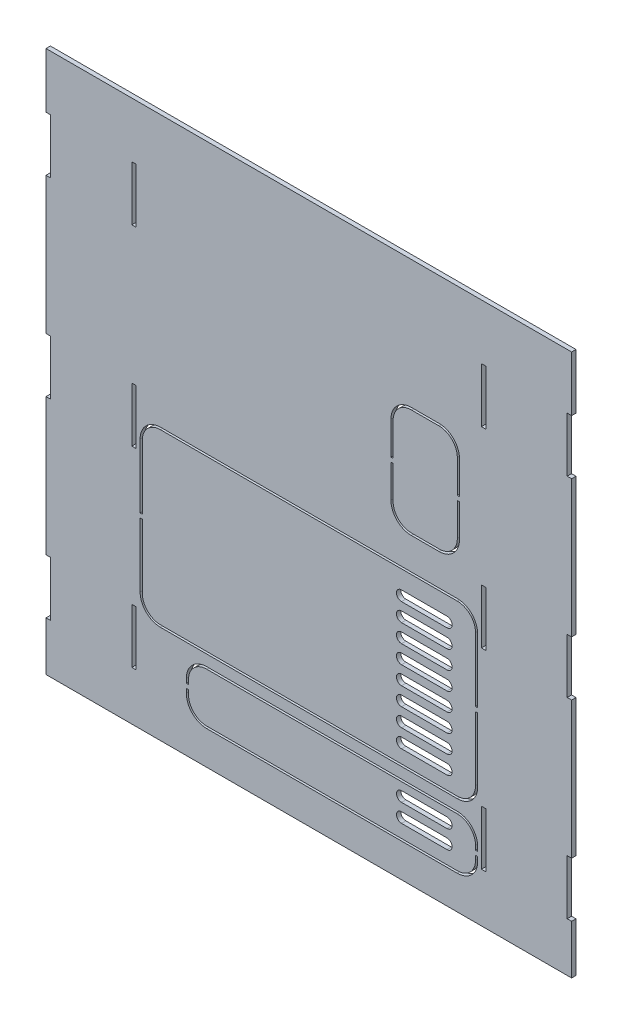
from build123d import *

# Parameters (mm, degrees)
SKETCH1_W           = 1.524
SKETCH1_H           = 19.05
BOSS_EXTRUDE1_DEPTH = 1.524
CUT_EXTRUDE1_DEPTH  = 1.524


with BuildPart() as part:
    # Sketch1 → Boss-Extrude1 (new body)
    with BuildSketch(Plane.XY):
        Polygon((-29.928313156, 36.883266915), (-28.404313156, 36.883266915), (-28.404313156, 17.833266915), (-29.928313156, 17.833266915), (-29.928313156, 0.710165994), (153.360857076, 0.710165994), (153.360857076, 17.833266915), (151.836857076, 17.833266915), (151.836857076, 36.883266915), (153.360857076, 36.883266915), (153.360857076, 84.667731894), (151.836857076, 84.667731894), (151.836857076, 103.717731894), (153.360857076, 103.717731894), (153.360857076, 151.502196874), (151.836857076, 151.502196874), (151.836857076, 170.552196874), (153.360857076, 170.552196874), (153.360857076, 189.786842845), (-29.928313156, 189.786842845), (-29.928313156, 170.552196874), (-28.404313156, 170.552196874), (-28.404313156, 151.502196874), (-29.928313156, 151.502196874), (-29.928313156, 103.717731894), (-28.404313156, 103.717731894), (-28.404313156, 84.667731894), (-29.928313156, 84.667731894), align=None)
        with Locations((122.67054392, 27.358266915)):
            Rectangle(SKETCH1_W, SKETCH1_H, mode=Mode.SUBTRACT)
        with Locations((122.67054392, 94.192731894)):
            Rectangle(SKETCH1_W, SKETCH1_H, mode=Mode.SUBTRACT)
        with Locations((122.67054392, 161.027196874)):
            Rectangle(SKETCH1_W, SKETCH1_H, mode=Mode.SUBTRACT)
        with Locations((0.762, 161.027196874)):
            Rectangle(SKETCH1_W, SKETCH1_H, mode=Mode.SUBTRACT)
        with Locations((0.762, 94.192731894)):
            Rectangle(SKETCH1_W, SKETCH1_H, mode=Mode.SUBTRACT)
        with Locations((0.762, 27.358266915)):
            Rectangle(SKETCH1_W, SKETCH1_H, mode=Mode.SUBTRACT)
    extrude(amount=BOSS_EXTRUDE1_DEPTH)

    # Sketch2 → Cut-Extrude1 (cut)
    with BuildSketch(Plane.XY.offset(1.524)):
        with BuildLine():
            Line((9.998551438, 35.700494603), (113.509256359, 35.700494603))
            ThreePointArc((113.509256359, 35.700494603), (117.99938442, 37.560366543), (119.859256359, 42.050494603))
            Line((119.859256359, 42.050494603), (119.859256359, 64.396557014))
            Line((119.859256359, 64.396557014), (120.621256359, 64.396557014))
            Line((120.621256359, 64.396557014), (120.621256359, 42.050494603))
            ThreePointArc((120.621256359, 42.050494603), (118.538199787, 37.021551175), (113.509256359, 34.938494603))
            Line((113.509256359, 34.938494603), (9.998551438, 34.938494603))
            ThreePointArc((9.998551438, 34.938494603), (4.96960801, 37.021551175), (2.886551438, 42.050494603))
            Line((2.886551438, 42.050494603), (2.886551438, 64.396557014))
            Line((2.886551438, 64.396557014), (3.648551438, 64.396557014))
            Line((3.648551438, 64.396557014), (3.648551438, 42.050494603))
            ThreePointArc((3.648551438, 42.050494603), (5.508423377, 37.560366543), (9.998551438, 35.700494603))
        make_face()
        with BuildLine():
            Line((9.998551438, 94.616619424), (113.509256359, 94.616619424))
            ThreePointArc((113.509256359, 94.616619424), (117.99938442, 92.756747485), (119.859256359, 88.266619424))
            Line((119.859256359, 88.266619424), (119.859256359, 65.920557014))
            Line((119.859256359, 65.920557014), (120.621256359, 65.920557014))
            Line((120.621256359, 65.920557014), (120.621256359, 88.266619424))
            ThreePointArc((120.621256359, 88.266619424), (118.538199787, 93.295562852), (113.509256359, 95.378619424))
            Line((113.509256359, 95.378619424), (9.998551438, 95.378619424))
            ThreePointArc((9.998551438, 95.378619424), (4.96960801, 93.295562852), (2.886551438, 88.266619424))
            Line((2.886551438, 88.266619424), (2.886551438, 65.920557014))
            Line((2.886551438, 65.920557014), (3.648551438, 65.920557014))
            Line((3.648551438, 65.920557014), (3.648551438, 88.266619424))
            ThreePointArc((3.648551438, 88.266619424), (5.508423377, 92.756747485), (9.998551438, 94.616619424))
        make_face()
        with BuildLine():
            Line((26.103996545, 30.362074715), (113.509256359, 30.362074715))
            ThreePointArc((113.509256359, 30.362074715), (117.99938442, 28.502202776), (119.859256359, 24.012074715))
            Line((119.859256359, 24.012074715), (119.859256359, 22.530678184))
            Line((119.859256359, 22.530678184), (120.621256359, 22.530678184))
            Line((120.621256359, 22.530678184), (120.621256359, 24.012074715))
            ThreePointArc((120.621256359, 24.012074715), (118.538199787, 29.041018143), (113.509256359, 31.124074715))
            Line((113.509256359, 31.124074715), (26.103996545, 31.124074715))
            ThreePointArc((26.103996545, 31.124074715), (21.075053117, 29.041018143), (18.991996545, 24.012074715))
            Line((18.991996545, 24.012074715), (18.991996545, 22.530678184))
            Line((18.991996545, 22.530678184), (19.753996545, 22.530678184))
            Line((19.753996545, 22.530678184), (19.753996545, 24.012074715))
            ThreePointArc((19.753996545, 24.012074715), (21.613868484, 28.502202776), (26.103996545, 30.362074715))
        make_face()
        with BuildLine():
            Line((26.103996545, 13.175281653), (113.509256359, 13.175281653))
            ThreePointArc((113.509256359, 13.175281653), (117.99938442, 15.035153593), (119.859256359, 19.525281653))
            Line((119.859256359, 19.525281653), (119.859256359, 21.006678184))
            Line((119.859256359, 21.006678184), (120.621256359, 21.006678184))
            Line((120.621256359, 21.006678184), (120.621256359, 19.525281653))
            ThreePointArc((120.621256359, 19.525281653), (118.538199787, 14.496338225), (113.509256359, 12.413281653))
            Line((113.509256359, 12.413281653), (26.103996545, 12.413281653))
            ThreePointArc((26.103996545, 12.413281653), (21.075053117, 14.496338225), (18.991996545, 19.525281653))
            Line((18.991996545, 19.525281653), (18.991996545, 21.006678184))
            Line((18.991996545, 21.006678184), (19.753996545, 21.006678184))
            Line((19.753996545, 21.006678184), (19.753996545, 19.525281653))
            ThreePointArc((19.753996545, 19.525281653), (21.613868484, 15.035153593), (26.103996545, 13.175281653))
        make_face()
        with BuildLine():
            Line((109.906663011, 17.758704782), (94.046471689, 17.758704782))
            ThreePointArc((94.046471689, 17.758704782), (92.279894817, 19.525281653), (94.046471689, 21.291858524))
            Line((94.046471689, 21.291858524), (109.906663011, 21.291858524))
            ThreePointArc((109.906663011, 21.291858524), (111.673239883, 19.525281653), (109.906663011, 17.758704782))
        make_face()
        with BuildLine():
            Line((109.906663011, 24.108704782), (94.046471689, 24.108704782))
            ThreePointArc((94.046471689, 24.108704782), (92.279894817, 25.875281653), (94.046471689, 27.641858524))
            Line((94.046471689, 27.641858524), (109.906663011, 27.641858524))
            ThreePointArc((109.906663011, 27.641858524), (111.673239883, 25.875281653), (109.906663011, 24.108704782))
        make_face()
        with BuildLine():
            Line((109.906663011, 40.283917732), (94.046471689, 40.283917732))
            ThreePointArc((94.046471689, 40.283917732), (92.279894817, 42.050494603), (94.046471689, 43.817071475))
            Line((94.046471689, 43.817071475), (109.906663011, 43.817071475))
            ThreePointArc((109.906663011, 43.817071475), (111.673239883, 42.050494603), (109.906663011, 40.283917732))
        make_face()
        with BuildLine():
            Line((109.906663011, 46.633917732), (94.046471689, 46.633917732))
            ThreePointArc((94.046471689, 46.633917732), (92.279894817, 48.400494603), (94.046471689, 50.167071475))
            Line((94.046471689, 50.167071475), (109.906663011, 50.167071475))
            ThreePointArc((109.906663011, 50.167071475), (111.673239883, 48.400494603), (109.906663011, 46.633917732))
        make_face()
        with BuildLine():
            Line((109.906663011, 52.983917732), (94.046471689, 52.983917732))
            ThreePointArc((94.046471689, 52.983917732), (92.279894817, 54.750494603), (94.046471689, 56.517071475))
            Line((94.046471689, 56.517071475), (109.906663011, 56.517071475))
            ThreePointArc((109.906663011, 56.517071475), (111.673239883, 54.750494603), (109.906663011, 52.983917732))
        make_face()
        with BuildLine():
            Line((109.906663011, 59.333917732), (94.046471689, 59.333917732))
            ThreePointArc((94.046471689, 59.333917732), (92.279894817, 61.100494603), (94.046471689, 62.867071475))
            Line((94.046471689, 62.867071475), (109.906663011, 62.867071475))
            ThreePointArc((109.906663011, 62.867071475), (111.673239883, 61.100494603), (109.906663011, 59.333917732))
        make_face()
        with BuildLine():
            Line((109.906663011, 65.683917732), (94.046471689, 65.683917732))
            ThreePointArc((94.046471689, 65.683917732), (92.279894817, 67.450494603), (94.046471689, 69.217071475))
            Line((94.046471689, 69.217071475), (109.906663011, 69.217071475))
            ThreePointArc((109.906663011, 69.217071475), (111.673239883, 67.450494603), (109.906663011, 65.683917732))
        make_face()
        with BuildLine():
            Line((109.906663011, 72.033917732), (94.046471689, 72.033917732))
            ThreePointArc((94.046471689, 72.033917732), (92.279894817, 73.800494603), (94.046471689, 75.567071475))
            Line((94.046471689, 75.567071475), (109.906663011, 75.567071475))
            ThreePointArc((109.906663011, 75.567071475), (111.673239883, 73.800494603), (109.906663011, 72.033917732))
        make_face()
        with BuildLine():
            Line((109.906663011, 78.383917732), (94.046471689, 78.383917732))
            ThreePointArc((94.046471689, 78.383917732), (92.279894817, 80.150494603), (94.046471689, 81.917071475))
            Line((94.046471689, 81.917071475), (109.906663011, 81.917071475))
            ThreePointArc((109.906663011, 81.917071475), (111.673239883, 80.150494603), (109.906663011, 78.383917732))
        make_face()
        with BuildLine():
            Line((109.906663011, 84.733917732), (94.046471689, 84.733917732))
            ThreePointArc((94.046471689, 84.733917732), (92.279894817, 86.500494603), (94.046471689, 88.267071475))
            Line((94.046471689, 88.267071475), (109.906663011, 88.267071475))
            ThreePointArc((109.906663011, 88.267071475), (111.673239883, 86.500494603), (109.906663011, 84.733917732))
        make_face()
        with BuildLine():
            Line((114.271256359, 113.532774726), (114.271256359, 124.997386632))
            Line((114.271256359, 124.997386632), (113.509256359, 124.997386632))
            Line((113.509256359, 124.997386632), (113.509256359, 113.532774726))
            ThreePointArc((113.509256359, 113.532774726), (111.64938442, 109.042646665), (107.159256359, 107.182774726))
            Line((107.159256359, 107.182774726), (97.463350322, 107.182774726))
            ThreePointArc((97.463350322, 107.182774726), (92.973222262, 109.042646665), (91.113350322, 113.532774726))
            Line((91.113350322, 113.532774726), (91.113350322, 124.997386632))
            Line((91.113350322, 124.997386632), (90.351350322, 124.997386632))
            Line((90.351350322, 124.997386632), (90.351350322, 113.532774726))
            ThreePointArc((90.351350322, 113.532774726), (92.434406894, 108.503831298), (97.463350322, 106.420774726))
            Line((97.463350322, 106.420774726), (107.159256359, 106.420774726))
            ThreePointArc((107.159256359, 106.420774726), (112.188199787, 108.503831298), (114.271256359, 113.532774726))
        make_face()
        with BuildLine():
            Line((107.159256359, 144.335998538), (97.463350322, 144.335998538))
            ThreePointArc((97.463350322, 144.335998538), (92.973222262, 142.476126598), (91.113350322, 137.985998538))
            Line((91.113350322, 137.985998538), (91.113350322, 126.521386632))
            Line((91.113350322, 126.521386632), (90.351350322, 126.521386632))
            Line((90.351350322, 126.521386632), (90.351350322, 137.985998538))
            ThreePointArc((90.351350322, 137.985998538), (92.434406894, 143.014941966), (97.463350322, 145.097998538))
            Line((97.463350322, 145.097998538), (107.159256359, 145.097998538))
            ThreePointArc((107.159256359, 145.097998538), (112.188199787, 143.014941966), (114.271256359, 137.985998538))
            Line((114.271256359, 137.985998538), (114.271256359, 126.521386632))
            Line((114.271256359, 126.521386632), (113.509256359, 126.521386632))
            Line((113.509256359, 126.521386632), (113.509256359, 137.985998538))
            ThreePointArc((113.509256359, 137.985998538), (111.64938442, 142.476126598), (107.159256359, 144.335998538))
        make_face()
    extrude(amount=-CUT_EXTRUDE1_DEPTH, mode=Mode.SUBTRACT)


solid = part.part
